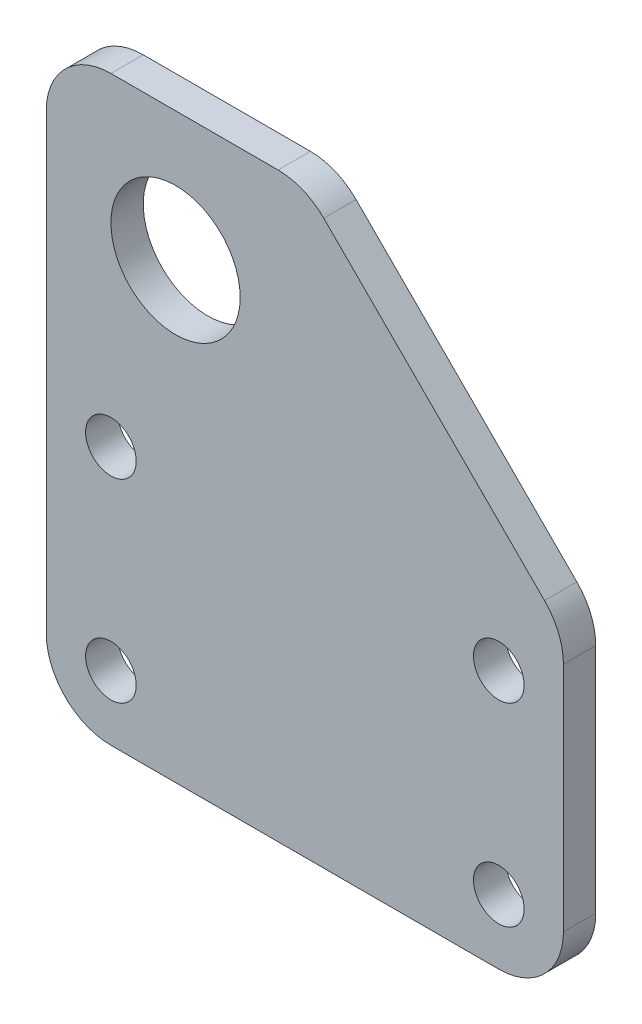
ISO-10303-21;
HEADER;
FILE_DESCRIPTION(('STEP AP214'),'2;1');
FILE_NAME('part.step','',(''),(''),'','','');
FILE_SCHEMA(('AUTOMOTIVE_DESIGN { 1 0 10303 214 1 1 1 1 }'));
ENDSEC;
DATA;
#1=APPLICATION_CONTEXT('core data for automotive mechanical design processes');
#2=APPLICATION_PROTOCOL_DEFINITION('international standard','automotive_design',2000,#1);
#3=PRODUCT_CONTEXT('',#1,'mechanical');
#4=PRODUCT('Part','Part','',(#3));
#5=PRODUCT_RELATED_PRODUCT_CATEGORY('part','',(#4));
#6=PRODUCT_DEFINITION_FORMATION('','',#4);
#7=PRODUCT_DEFINITION_CONTEXT('part definition',#1,'design');
#8=PRODUCT_DEFINITION('design','',#6,#7);
#9=PRODUCT_DEFINITION_SHAPE('','',#8);
#10=(LENGTH_UNIT() NAMED_UNIT(*) SI_UNIT(.MILLI.,.METRE.));
#11=(NAMED_UNIT(*) PLANE_ANGLE_UNIT() SI_UNIT($,.RADIAN.));
#12=(NAMED_UNIT(*) SI_UNIT($,.STERADIAN.) SOLID_ANGLE_UNIT());
#13=UNCERTAINTY_MEASURE_WITH_UNIT(LENGTH_MEASURE(1.E-05),#10,'distance_accuracy_value','');
#14=(GEOMETRIC_REPRESENTATION_CONTEXT(3) GLOBAL_UNCERTAINTY_ASSIGNED_CONTEXT((#13)) GLOBAL_UNIT_ASSIGNED_CONTEXT((#10,
#11,#12)) REPRESENTATION_CONTEXT('',''));
#15=CARTESIAN_POINT('',(0.,0.,0.));
#16=DIRECTION('',(0.,0.,1.));
#17=DIRECTION('',(1.,0.,0.));
#18=AXIS2_PLACEMENT_3D('',#15,#16,#17);
#19=CARTESIAN_POINT('',(0.,0.,3.175));
#20=DIRECTION('',(0.,0.,-1.));
#21=DIRECTION('',(-1.,0.,0.));
#22=AXIS2_PLACEMENT_3D('',#19,#20,#21);
#23=PLANE('',#22);
#24=DIRECTION('',(-1.,0.,0.));
#25=VECTOR('',#24,1.);
#26=CARTESIAN_POINT('',(0.,57.15,3.175));
#27=LINE('',#26,#25);
#28=CARTESIAN_POINT('',(22.7697438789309,57.15,3.175));
#29=VERTEX_POINT('',#28);
#30=CARTESIAN_POINT('',(6.35,57.15,3.175));
#31=VERTEX_POINT('',#30);
#32=EDGE_CURVE('E193',#29,#31,#27,.T.);
#33=ORIENTED_EDGE('',*,*,#32,.T.);
#34=CARTESIAN_POINT('',(6.35,50.8,3.175));
#35=DIRECTION('',(0.,0.,-1.));
#36=DIRECTION('',(-1.,0.,0.));
#37=AXIS2_PLACEMENT_3D('',#34,#35,#36);
#38=CIRCLE('',#37,6.35);
#39=CARTESIAN_POINT('',(0.,50.8,3.175));
#40=VERTEX_POINT('',#39);
#41=EDGE_CURVE('E167',#31,#40,#38,.F.);
#42=ORIENTED_EDGE('',*,*,#41,.T.);
#43=DIRECTION('',(0.,-1.,0.));
#44=VECTOR('',#43,1.);
#45=CARTESIAN_POINT('',(0.,0.,3.175));
#46=LINE('',#45,#44);
#47=CARTESIAN_POINT('',(0.,6.35,3.175));
#48=VERTEX_POINT('',#47);
#49=EDGE_CURVE('E133',#40,#48,#46,.T.);
#50=ORIENTED_EDGE('',*,*,#49,.T.);
#51=CARTESIAN_POINT('',(6.35,6.35,3.175));
#52=DIRECTION('',(0.,0.,-1.));
#53=DIRECTION('',(-1.,0.,0.));
#54=AXIS2_PLACEMENT_3D('',#51,#52,#53);
#55=CIRCLE('',#54,6.35);
#56=CARTESIAN_POINT('',(6.35,0.,3.175));
#57=VERTEX_POINT('',#56);
#58=EDGE_CURVE('E57',#48,#57,#55,.F.);
#59=ORIENTED_EDGE('',*,*,#58,.T.);
#60=DIRECTION('',(1.,0.,0.));
#61=VECTOR('',#60,1.);
#62=CARTESIAN_POINT('',(50.8,0.,3.175));
#63=LINE('',#62,#61);
#64=CARTESIAN_POINT('',(44.45,0.,3.175));
#65=VERTEX_POINT('',#64);
#66=EDGE_CURVE('E149',#57,#65,#63,.T.);
#67=ORIENTED_EDGE('',*,*,#66,.T.);
#68=CARTESIAN_POINT('',(44.45,6.35,3.175));
#69=DIRECTION('',(0.,0.,-1.));
#70=DIRECTION('',(-1.,0.,0.));
#71=AXIS2_PLACEMENT_3D('',#68,#69,#70);
#72=CIRCLE('',#71,6.35);
#73=CARTESIAN_POINT('',(50.8,6.35,3.175));
#74=VERTEX_POINT('',#73);
#75=EDGE_CURVE('E164',#65,#74,#72,.F.);
#76=ORIENTED_EDGE('',*,*,#75,.T.);
#77=DIRECTION('',(0.,1.,0.));
#78=VECTOR('',#77,1.);
#79=CARTESIAN_POINT('',(50.8,0.,3.175));
#80=LINE('',#79,#78);
#81=CARTESIAN_POINT('',(50.8,29.1197438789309,3.175));
#82=VERTEX_POINT('',#81);
#83=EDGE_CURVE('E143',#74,#82,#80,.T.);
#84=ORIENTED_EDGE('',*,*,#83,.T.);
#85=CARTESIAN_POINT('',(44.45,29.1197438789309,3.175));
#86=DIRECTION('',(0.,0.,-1.));
#87=DIRECTION('',(-1.,0.,0.));
#88=AXIS2_PLACEMENT_3D('',#85,#86,#87);
#89=CIRCLE('',#88,6.35);
#90=CARTESIAN_POINT('',(48.9401280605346,33.6098719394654,3.175));
#91=VERTEX_POINT('',#90);
#92=EDGE_CURVE('E162',#82,#91,#89,.F.);
#93=ORIENTED_EDGE('',*,*,#92,.T.);
#94=DIRECTION('',(-0.707106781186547,0.707106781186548,0.));
#95=VECTOR('',#94,1.);
#96=CARTESIAN_POINT('',(50.8,31.75,3.175));
#97=LINE('',#96,#95);
#98=CARTESIAN_POINT('',(27.2598719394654,55.2901280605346,3.175));
#99=VERTEX_POINT('',#98);
#100=EDGE_CURVE('E183',#91,#99,#97,.T.);
#101=ORIENTED_EDGE('',*,*,#100,.T.);
#102=CARTESIAN_POINT('',(22.7697438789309,50.8,3.175));
#103=DIRECTION('',(0.,0.,-1.));
#104=DIRECTION('',(-1.,0.,0.));
#105=AXIS2_PLACEMENT_3D('',#102,#103,#104);
#106=CIRCLE('',#105,6.35);
#107=EDGE_CURVE('E160',#99,#29,#106,.F.);
#108=ORIENTED_EDGE('',*,*,#107,.T.);
#109=EDGE_LOOP('',(#33,#42,#50,#59,#67,#76,#84,#93,#101,#108));
#110=FACE_BOUND('',#109,.T.);
#111=CARTESIAN_POINT('',(6.35,25.4,3.175));
#112=DIRECTION('',(0.,0.,1.));
#113=DIRECTION('',(1.,0.,0.));
#114=AXIS2_PLACEMENT_3D('',#111,#112,#113);
#115=CIRCLE('',#114,2.4892);
#116=CARTESIAN_POINT('',(8.8392,25.4,3.175));
#117=VERTEX_POINT('',#116);
#118=EDGE_CURVE('E201',#117,#117,#115,.T.);
#119=ORIENTED_EDGE('',*,*,#118,.F.);
#120=EDGE_LOOP('',(#119));
#121=FACE_BOUND('',#120,.T.);
#122=CARTESIAN_POINT('',(44.45,25.4,3.175));
#123=DIRECTION('',(0.,0.,1.));
#124=DIRECTION('',(1.,0.,0.));
#125=AXIS2_PLACEMENT_3D('',#122,#123,#124);
#126=CIRCLE('',#125,2.4892);
#127=CARTESIAN_POINT('',(46.9392,25.4,3.175));
#128=VERTEX_POINT('',#127);
#129=EDGE_CURVE('E211',#128,#128,#126,.T.);
#130=ORIENTED_EDGE('',*,*,#129,.F.);
#131=EDGE_LOOP('',(#130));
#132=FACE_BOUND('',#131,.T.);
#133=CARTESIAN_POINT('',(44.45,6.35000000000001,3.175));
#134=DIRECTION('',(0.,0.,1.));
#135=DIRECTION('',(1.,0.,0.));
#136=AXIS2_PLACEMENT_3D('',#133,#134,#135);
#137=CIRCLE('',#136,2.4892);
#138=CARTESIAN_POINT('',(46.9392,6.35000000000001,3.175));
#139=VERTEX_POINT('',#138);
#140=EDGE_CURVE('E217',#139,#139,#137,.T.);
#141=ORIENTED_EDGE('',*,*,#140,.F.);
#142=EDGE_LOOP('',(#141));
#143=FACE_BOUND('',#142,.T.);
#144=CARTESIAN_POINT('',(6.35,6.34999999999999,3.175));
#145=DIRECTION('',(0.,0.,1.));
#146=DIRECTION('',(1.,0.,0.));
#147=AXIS2_PLACEMENT_3D('',#144,#145,#146);
#148=CIRCLE('',#147,2.4892);
#149=CARTESIAN_POINT('',(8.8392,6.34999999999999,3.175));
#150=VERTEX_POINT('',#149);
#151=EDGE_CURVE('E223',#150,#150,#148,.T.);
#152=ORIENTED_EDGE('',*,*,#151,.F.);
#153=EDGE_LOOP('',(#152));
#154=FACE_BOUND('',#153,.T.);
#155=CARTESIAN_POINT('',(12.7,44.45,3.175));
#156=DIRECTION('',(0.,0.,1.));
#157=DIRECTION('',(1.,0.,0.));
#158=AXIS2_PLACEMENT_3D('',#155,#156,#157);
#159=CIRCLE('',#158,6.35);
#160=CARTESIAN_POINT('',(19.05,44.45,3.175));
#161=VERTEX_POINT('',#160);
#162=EDGE_CURVE('E229',#161,#161,#159,.T.);
#163=ORIENTED_EDGE('',*,*,#162,.F.);
#164=EDGE_LOOP('',(#163));
#165=FACE_BOUND('',#164,.T.);
#166=ADVANCED_FACE('F35',(#110,#121,#132,#143,#154,#165),#23,.F.);
#167=CARTESIAN_POINT('',(0.,0.,0.));
#168=DIRECTION('',(0.,0.,-1.));
#169=DIRECTION('',(-1.,0.,0.));
#170=AXIS2_PLACEMENT_3D('',#167,#168,#169);
#171=PLANE('',#170);
#172=CARTESIAN_POINT('',(6.35,6.34999999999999,0.));
#173=DIRECTION('',(0.,0.,1.));
#174=DIRECTION('',(1.,0.,0.));
#175=AXIS2_PLACEMENT_3D('',#172,#173,#174);
#176=CIRCLE('',#175,2.4892);
#177=CARTESIAN_POINT('',(8.8392,6.34999999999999,0.));
#178=VERTEX_POINT('',#177);
#179=EDGE_CURVE('E226',#178,#178,#176,.T.);
#180=ORIENTED_EDGE('',*,*,#179,.T.);
#181=EDGE_LOOP('',(#180));
#182=FACE_BOUND('',#181,.T.);
#183=CARTESIAN_POINT('',(44.45,25.4,0.));
#184=DIRECTION('',(0.,0.,1.));
#185=DIRECTION('',(1.,0.,0.));
#186=AXIS2_PLACEMENT_3D('',#183,#184,#185);
#187=CIRCLE('',#186,2.4892);
#188=CARTESIAN_POINT('',(46.9392,25.4,0.));
#189=VERTEX_POINT('',#188);
#190=EDGE_CURVE('E214',#189,#189,#187,.T.);
#191=ORIENTED_EDGE('',*,*,#190,.T.);
#192=EDGE_LOOP('',(#191));
#193=FACE_BOUND('',#192,.T.);
#194=DIRECTION('',(0.,-1.,0.));
#195=VECTOR('',#194,1.);
#196=CARTESIAN_POINT('',(0.,0.,0.));
#197=LINE('',#196,#195);
#198=CARTESIAN_POINT('',(0.,50.8,0.));
#199=VERTEX_POINT('',#198);
#200=CARTESIAN_POINT('',(0.,6.35,0.));
#201=VERTEX_POINT('',#200);
#202=EDGE_CURVE('E131',#199,#201,#197,.T.);
#203=ORIENTED_EDGE('',*,*,#202,.F.);
#204=CARTESIAN_POINT('',(6.35,50.8,0.));
#205=DIRECTION('',(0.,0.,-1.));
#206=DIRECTION('',(-1.,0.,0.));
#207=AXIS2_PLACEMENT_3D('',#204,#205,#206);
#208=CIRCLE('',#207,6.35);
#209=CARTESIAN_POINT('',(6.35,57.15,0.));
#210=VERTEX_POINT('',#209);
#211=EDGE_CURVE('E114',#199,#210,#208,.T.);
#212=ORIENTED_EDGE('',*,*,#211,.T.);
#213=DIRECTION('',(-1.,0.,0.));
#214=VECTOR('',#213,1.);
#215=CARTESIAN_POINT('',(0.,57.15,0.));
#216=LINE('',#215,#214);
#217=CARTESIAN_POINT('',(22.7697438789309,57.15,0.));
#218=VERTEX_POINT('',#217);
#219=EDGE_CURVE('E141',#218,#210,#216,.T.);
#220=ORIENTED_EDGE('',*,*,#219,.F.);
#221=CARTESIAN_POINT('',(22.7697438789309,50.8,0.));
#222=DIRECTION('',(0.,0.,-1.));
#223=DIRECTION('',(-1.,0.,0.));
#224=AXIS2_PLACEMENT_3D('',#221,#222,#223);
#225=CIRCLE('',#224,6.35);
#226=CARTESIAN_POINT('',(27.2598719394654,55.2901280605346,0.));
#227=VERTEX_POINT('',#226);
#228=EDGE_CURVE('E134',#218,#227,#225,.T.);
#229=ORIENTED_EDGE('',*,*,#228,.T.);
#230=DIRECTION('',(-0.707106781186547,0.707106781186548,0.));
#231=VECTOR('',#230,1.);
#232=CARTESIAN_POINT('',(50.8,31.75,0.));
#233=LINE('',#232,#231);
#234=CARTESIAN_POINT('',(48.9401280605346,33.6098719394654,0.));
#235=VERTEX_POINT('',#234);
#236=EDGE_CURVE('E145',#235,#227,#233,.T.);
#237=ORIENTED_EDGE('',*,*,#236,.F.);
#238=CARTESIAN_POINT('',(44.45,29.1197438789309,0.));
#239=DIRECTION('',(0.,0.,-1.));
#240=DIRECTION('',(-1.,0.,0.));
#241=AXIS2_PLACEMENT_3D('',#238,#239,#240);
#242=CIRCLE('',#241,6.35);
#243=CARTESIAN_POINT('',(50.8,29.1197438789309,0.));
#244=VERTEX_POINT('',#243);
#245=EDGE_CURVE('E152',#235,#244,#242,.T.);
#246=ORIENTED_EDGE('',*,*,#245,.T.);
#247=DIRECTION('',(0.,1.,0.));
#248=VECTOR('',#247,1.);
#249=CARTESIAN_POINT('',(50.8,0.,0.));
#250=LINE('',#249,#248);
#251=CARTESIAN_POINT('',(50.8,6.35,0.));
#252=VERTEX_POINT('',#251);
#253=EDGE_CURVE('E200',#252,#244,#250,.T.);
#254=ORIENTED_EDGE('',*,*,#253,.F.);
#255=CARTESIAN_POINT('',(44.45,6.35,0.));
#256=DIRECTION('',(0.,0.,-1.));
#257=DIRECTION('',(-1.,0.,0.));
#258=AXIS2_PLACEMENT_3D('',#255,#256,#257);
#259=CIRCLE('',#258,6.35);
#260=CARTESIAN_POINT('',(44.45,0.,0.));
#261=VERTEX_POINT('',#260);
#262=EDGE_CURVE('E154',#252,#261,#259,.T.);
#263=ORIENTED_EDGE('',*,*,#262,.T.);
#264=DIRECTION('',(1.,0.,0.));
#265=VECTOR('',#264,1.);
#266=CARTESIAN_POINT('',(50.8,0.,0.));
#267=LINE('',#266,#265);
#268=CARTESIAN_POINT('',(6.35,0.,0.));
#269=VERTEX_POINT('',#268);
#270=EDGE_CURVE('E140',#269,#261,#267,.T.);
#271=ORIENTED_EDGE('',*,*,#270,.F.);
#272=CARTESIAN_POINT('',(6.35,6.35,0.));
#273=DIRECTION('',(0.,0.,-1.));
#274=DIRECTION('',(-1.,0.,0.));
#275=AXIS2_PLACEMENT_3D('',#272,#273,#274);
#276=CIRCLE('',#275,6.35);
#277=EDGE_CURVE('E125',#269,#201,#276,.T.);
#278=ORIENTED_EDGE('',*,*,#277,.T.);
#279=EDGE_LOOP('',(#203,#212,#220,#229,#237,#246,#254,#263,#271,#278));
#280=FACE_BOUND('',#279,.T.);
#281=CARTESIAN_POINT('',(6.35,25.4,0.));
#282=DIRECTION('',(0.,0.,1.));
#283=DIRECTION('',(1.,0.,0.));
#284=AXIS2_PLACEMENT_3D('',#281,#282,#283);
#285=CIRCLE('',#284,2.4892);
#286=CARTESIAN_POINT('',(8.8392,25.4,0.));
#287=VERTEX_POINT('',#286);
#288=EDGE_CURVE('E208',#287,#287,#285,.T.);
#289=ORIENTED_EDGE('',*,*,#288,.T.);
#290=EDGE_LOOP('',(#289));
#291=FACE_BOUND('',#290,.T.);
#292=CARTESIAN_POINT('',(44.45,6.35000000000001,0.));
#293=DIRECTION('',(0.,0.,1.));
#294=DIRECTION('',(1.,0.,0.));
#295=AXIS2_PLACEMENT_3D('',#292,#293,#294);
#296=CIRCLE('',#295,2.4892);
#297=CARTESIAN_POINT('',(46.9392,6.35000000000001,0.));
#298=VERTEX_POINT('',#297);
#299=EDGE_CURVE('E220',#298,#298,#296,.T.);
#300=ORIENTED_EDGE('',*,*,#299,.T.);
#301=EDGE_LOOP('',(#300));
#302=FACE_BOUND('',#301,.T.);
#303=CARTESIAN_POINT('',(12.7,44.45,0.));
#304=DIRECTION('',(0.,0.,1.));
#305=DIRECTION('',(1.,0.,0.));
#306=AXIS2_PLACEMENT_3D('',#303,#304,#305);
#307=CIRCLE('',#306,6.35);
#308=CARTESIAN_POINT('',(19.05,44.45,0.));
#309=VERTEX_POINT('',#308);
#310=EDGE_CURVE('E232',#309,#309,#307,.T.);
#311=ORIENTED_EDGE('',*,*,#310,.T.);
#312=EDGE_LOOP('',(#311));
#313=FACE_BOUND('',#312,.T.);
#314=ADVANCED_FACE('F137',(#182,#193,#280,#291,#302,#313),#171,.T.);
#315=CARTESIAN_POINT('',(50.8,0.,3.175));
#316=DIRECTION('',(-1.,0.,0.));
#317=DIRECTION('',(0.,0.,1.));
#318=AXIS2_PLACEMENT_3D('',#315,#316,#317);
#319=PLANE('',#318);
#320=ORIENTED_EDGE('',*,*,#83,.F.);
#321=DIRECTION('',(0.,0.,-1.));
#322=VECTOR('',#321,1.);
#323=CARTESIAN_POINT('',(50.8,6.35,3.175));
#324=LINE('',#323,#322);
#325=EDGE_CURVE('E175',#74,#252,#324,.T.);
#326=ORIENTED_EDGE('',*,*,#325,.T.);
#327=ORIENTED_EDGE('',*,*,#253,.T.);
#328=DIRECTION('',(0.,0.,-1.));
#329=VECTOR('',#328,1.);
#330=CARTESIAN_POINT('',(50.8,29.1197438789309,3.175));
#331=LINE('',#330,#329);
#332=EDGE_CURVE('E173',#244,#82,#331,.F.);
#333=ORIENTED_EDGE('',*,*,#332,.T.);
#334=EDGE_LOOP('',(#320,#326,#327,#333));
#335=FACE_BOUND('',#334,.T.);
#336=ADVANCED_FACE('F246',(#335),#319,.F.);
#337=CARTESIAN_POINT('',(50.8,31.75,3.175));
#338=DIRECTION('',(-0.707106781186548,-0.707106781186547,0.));
#339=DIRECTION('',(0.707106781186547,-0.707106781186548,0.));
#340=AXIS2_PLACEMENT_3D('',#337,#338,#339);
#341=PLANE('',#340);
#342=ORIENTED_EDGE('',*,*,#100,.F.);
#343=DIRECTION('',(0.,0.,-1.));
#344=VECTOR('',#343,1.);
#345=CARTESIAN_POINT('',(48.9401280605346,33.6098719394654,3.175));
#346=LINE('',#345,#344);
#347=EDGE_CURVE('E11',#91,#235,#346,.T.);
#348=ORIENTED_EDGE('',*,*,#347,.T.);
#349=ORIENTED_EDGE('',*,*,#236,.T.);
#350=DIRECTION('',(0.,0.,-1.));
#351=VECTOR('',#350,1.);
#352=CARTESIAN_POINT('',(27.2598719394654,55.2901280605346,3.175));
#353=LINE('',#352,#351);
#354=EDGE_CURVE('E43',#227,#99,#353,.F.);
#355=ORIENTED_EDGE('',*,*,#354,.T.);
#356=EDGE_LOOP('',(#342,#348,#349,#355));
#357=FACE_BOUND('',#356,.T.);
#358=ADVANCED_FACE('F182',(#357),#341,.F.);
#359=CARTESIAN_POINT('',(0.,57.15,3.175));
#360=DIRECTION('',(0.,-1.,0.));
#361=DIRECTION('',(1.,0.,0.));
#362=AXIS2_PLACEMENT_3D('',#359,#360,#361);
#363=PLANE('',#362);
#364=ORIENTED_EDGE('',*,*,#219,.T.);
#365=DIRECTION('',(0.,0.,-1.));
#366=VECTOR('',#365,1.);
#367=CARTESIAN_POINT('',(6.35,57.15,3.175));
#368=LINE('',#367,#366);
#369=EDGE_CURVE('E119',#210,#31,#368,.F.);
#370=ORIENTED_EDGE('',*,*,#369,.T.);
#371=ORIENTED_EDGE('',*,*,#32,.F.);
#372=DIRECTION('',(0.,0.,-1.));
#373=VECTOR('',#372,1.);
#374=CARTESIAN_POINT('',(22.7697438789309,57.15,3.175));
#375=LINE('',#374,#373);
#376=EDGE_CURVE('E124',#29,#218,#375,.T.);
#377=ORIENTED_EDGE('',*,*,#376,.T.);
#378=EDGE_LOOP('',(#364,#370,#371,#377));
#379=FACE_BOUND('',#378,.T.);
#380=ADVANCED_FACE('F197',(#379),#363,.F.);
#381=CARTESIAN_POINT('',(0.,0.,3.175));
#382=DIRECTION('',(1.,0.,0.));
#383=DIRECTION('',(0.,0.,-1.));
#384=AXIS2_PLACEMENT_3D('',#381,#382,#383);
#385=PLANE('',#384);
#386=ORIENTED_EDGE('',*,*,#49,.F.);
#387=DIRECTION('',(0.,0.,-1.));
#388=VECTOR('',#387,1.);
#389=CARTESIAN_POINT('',(0.,50.8,3.175));
#390=LINE('',#389,#388);
#391=EDGE_CURVE('E118',#40,#199,#390,.T.);
#392=ORIENTED_EDGE('',*,*,#391,.T.);
#393=ORIENTED_EDGE('',*,*,#202,.T.);
#394=DIRECTION('',(0.,0.,-1.));
#395=VECTOR('',#394,1.);
#396=CARTESIAN_POINT('',(0.,6.35,3.175));
#397=LINE('',#396,#395);
#398=EDGE_CURVE('E135',#201,#48,#397,.F.);
#399=ORIENTED_EDGE('',*,*,#398,.T.);
#400=EDGE_LOOP('',(#386,#392,#393,#399));
#401=FACE_BOUND('',#400,.T.);
#402=ADVANCED_FACE('F130',(#401),#385,.F.);
#403=CARTESIAN_POINT('',(50.8,0.,3.175));
#404=DIRECTION('',(0.,1.,0.));
#405=DIRECTION('',(-1.,0.,0.));
#406=AXIS2_PLACEMENT_3D('',#403,#404,#405);
#407=PLANE('',#406);
#408=ORIENTED_EDGE('',*,*,#66,.F.);
#409=DIRECTION('',(0.,0.,-1.));
#410=VECTOR('',#409,1.);
#411=CARTESIAN_POINT('',(6.35,0.,3.175));
#412=LINE('',#411,#410);
#413=EDGE_CURVE('E170',#57,#269,#412,.T.);
#414=ORIENTED_EDGE('',*,*,#413,.T.);
#415=ORIENTED_EDGE('',*,*,#270,.T.);
#416=DIRECTION('',(0.,0.,-1.));
#417=VECTOR('',#416,1.);
#418=CARTESIAN_POINT('',(44.45,0.,3.175));
#419=LINE('',#418,#417);
#420=EDGE_CURVE('E50',#261,#65,#419,.F.);
#421=ORIENTED_EDGE('',*,*,#420,.T.);
#422=EDGE_LOOP('',(#408,#414,#415,#421));
#423=FACE_BOUND('',#422,.T.);
#424=ADVANCED_FACE('F253',(#423),#407,.F.);
#425=CARTESIAN_POINT('',(6.35,25.4,3.175));
#426=DIRECTION('',(0.,0.,-1.));
#427=DIRECTION('',(-1.,0.,0.));
#428=AXIS2_PLACEMENT_3D('',#425,#426,#427);
#429=CYLINDRICAL_SURFACE('',#428,2.4892);
#430=ORIENTED_EDGE('',*,*,#118,.T.);
#431=EDGE_LOOP('',(#430));
#432=FACE_BOUND('',#431,.T.);
#433=ORIENTED_EDGE('',*,*,#288,.F.);
#434=EDGE_LOOP('',(#433));
#435=FACE_BOUND('',#434,.T.);
#436=ADVANCED_FACE('F250',(#432,#435),#429,.F.);
#437=CARTESIAN_POINT('',(44.45,25.4,3.175));
#438=DIRECTION('',(0.,0.,-1.));
#439=DIRECTION('',(-1.,0.,0.));
#440=AXIS2_PLACEMENT_3D('',#437,#438,#439);
#441=CYLINDRICAL_SURFACE('',#440,2.4892);
#442=ORIENTED_EDGE('',*,*,#129,.T.);
#443=EDGE_LOOP('',(#442));
#444=FACE_BOUND('',#443,.T.);
#445=ORIENTED_EDGE('',*,*,#190,.F.);
#446=EDGE_LOOP('',(#445));
#447=FACE_BOUND('',#446,.T.);
#448=ADVANCED_FACE('F379',(#444,#447),#441,.F.);
#449=CARTESIAN_POINT('',(44.45,6.35000000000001,3.175));
#450=DIRECTION('',(0.,0.,-1.));
#451=DIRECTION('',(-1.,0.,0.));
#452=AXIS2_PLACEMENT_3D('',#449,#450,#451);
#453=CYLINDRICAL_SURFACE('',#452,2.4892);
#454=ORIENTED_EDGE('',*,*,#140,.T.);
#455=EDGE_LOOP('',(#454));
#456=FACE_BOUND('',#455,.T.);
#457=ORIENTED_EDGE('',*,*,#299,.F.);
#458=EDGE_LOOP('',(#457));
#459=FACE_BOUND('',#458,.T.);
#460=ADVANCED_FACE('F369',(#456,#459),#453,.F.);
#461=CARTESIAN_POINT('',(6.35,6.34999999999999,3.175));
#462=DIRECTION('',(0.,0.,-1.));
#463=DIRECTION('',(-1.,0.,0.));
#464=AXIS2_PLACEMENT_3D('',#461,#462,#463);
#465=CYLINDRICAL_SURFACE('',#464,2.4892);
#466=ORIENTED_EDGE('',*,*,#151,.T.);
#467=EDGE_LOOP('',(#466));
#468=FACE_BOUND('',#467,.T.);
#469=ORIENTED_EDGE('',*,*,#179,.F.);
#470=EDGE_LOOP('',(#469));
#471=FACE_BOUND('',#470,.T.);
#472=ADVANCED_FACE('F360',(#468,#471),#465,.F.);
#473=CARTESIAN_POINT('',(12.7,44.45,3.175));
#474=DIRECTION('',(0.,0.,-1.));
#475=DIRECTION('',(-1.,0.,0.));
#476=AXIS2_PLACEMENT_3D('',#473,#474,#475);
#477=CYLINDRICAL_SURFACE('',#476,6.35);
#478=ORIENTED_EDGE('',*,*,#162,.T.);
#479=EDGE_LOOP('',(#478));
#480=FACE_BOUND('',#479,.T.);
#481=ORIENTED_EDGE('',*,*,#310,.F.);
#482=EDGE_LOOP('',(#481));
#483=FACE_BOUND('',#482,.T.);
#484=ADVANCED_FACE('F238',(#480,#483),#477,.F.);
#485=CARTESIAN_POINT('',(6.35,50.8,3.175));
#486=DIRECTION('',(0.,0.,-1.));
#487=DIRECTION('',(-1.,0.,0.));
#488=AXIS2_PLACEMENT_3D('',#485,#486,#487);
#489=CYLINDRICAL_SURFACE('',#488,6.35);
#490=ORIENTED_EDGE('',*,*,#41,.F.);
#491=ORIENTED_EDGE('',*,*,#369,.F.);
#492=ORIENTED_EDGE('',*,*,#211,.F.);
#493=ORIENTED_EDGE('',*,*,#391,.F.);
#494=EDGE_LOOP('',(#490,#491,#492,#493));
#495=FACE_BOUND('',#494,.T.);
#496=ADVANCED_FACE('F117',(#495),#489,.T.);
#497=CARTESIAN_POINT('',(6.35,6.35,3.175));
#498=DIRECTION('',(0.,0.,-1.));
#499=DIRECTION('',(-1.,0.,0.));
#500=AXIS2_PLACEMENT_3D('',#497,#498,#499);
#501=CYLINDRICAL_SURFACE('',#500,6.35);
#502=ORIENTED_EDGE('',*,*,#58,.F.);
#503=ORIENTED_EDGE('',*,*,#398,.F.);
#504=ORIENTED_EDGE('',*,*,#277,.F.);
#505=ORIENTED_EDGE('',*,*,#413,.F.);
#506=EDGE_LOOP('',(#502,#503,#504,#505));
#507=FACE_BOUND('',#506,.T.);
#508=ADVANCED_FACE('F267',(#507),#501,.T.);
#509=CARTESIAN_POINT('',(44.45,6.35,3.175));
#510=DIRECTION('',(0.,0.,-1.));
#511=DIRECTION('',(-1.,0.,0.));
#512=AXIS2_PLACEMENT_3D('',#509,#510,#511);
#513=CYLINDRICAL_SURFACE('',#512,6.35);
#514=ORIENTED_EDGE('',*,*,#75,.F.);
#515=ORIENTED_EDGE('',*,*,#420,.F.);
#516=ORIENTED_EDGE('',*,*,#262,.F.);
#517=ORIENTED_EDGE('',*,*,#325,.F.);
#518=EDGE_LOOP('',(#514,#515,#516,#517));
#519=FACE_BOUND('',#518,.T.);
#520=ADVANCED_FACE('F270',(#519),#513,.T.);
#521=CARTESIAN_POINT('',(44.45,29.1197438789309,3.175));
#522=DIRECTION('',(0.,0.,-1.));
#523=DIRECTION('',(-1.,0.,0.));
#524=AXIS2_PLACEMENT_3D('',#521,#522,#523);
#525=CYLINDRICAL_SURFACE('',#524,6.35);
#526=ORIENTED_EDGE('',*,*,#92,.F.);
#527=ORIENTED_EDGE('',*,*,#332,.F.);
#528=ORIENTED_EDGE('',*,*,#245,.F.);
#529=ORIENTED_EDGE('',*,*,#347,.F.);
#530=EDGE_LOOP('',(#526,#527,#528,#529));
#531=FACE_BOUND('',#530,.T.);
#532=ADVANCED_FACE('F273',(#531),#525,.T.);
#533=CARTESIAN_POINT('',(22.7697438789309,50.8,3.175));
#534=DIRECTION('',(0.,0.,-1.));
#535=DIRECTION('',(-1.,0.,0.));
#536=AXIS2_PLACEMENT_3D('',#533,#534,#535);
#537=CYLINDRICAL_SURFACE('',#536,6.35);
#538=ORIENTED_EDGE('',*,*,#107,.F.);
#539=ORIENTED_EDGE('',*,*,#354,.F.);
#540=ORIENTED_EDGE('',*,*,#228,.F.);
#541=ORIENTED_EDGE('',*,*,#376,.F.);
#542=EDGE_LOOP('',(#538,#539,#540,#541));
#543=FACE_BOUND('',#542,.T.);
#544=ADVANCED_FACE('F37',(#543),#537,.T.);
#545=CLOSED_SHELL('',(#166,#314,#336,#358,#380,#402,#424,#436,#448,#460,#472,#484,#496,#508,
#520,#532,#544));
#546=MANIFOLD_SOLID_BREP('B2',#545);
#547=ADVANCED_BREP_SHAPE_REPRESENTATION('',(#18,#546),#14);
#548=SHAPE_DEFINITION_REPRESENTATION(#9,#547);
ENDSEC;
END-ISO-10303-21;
